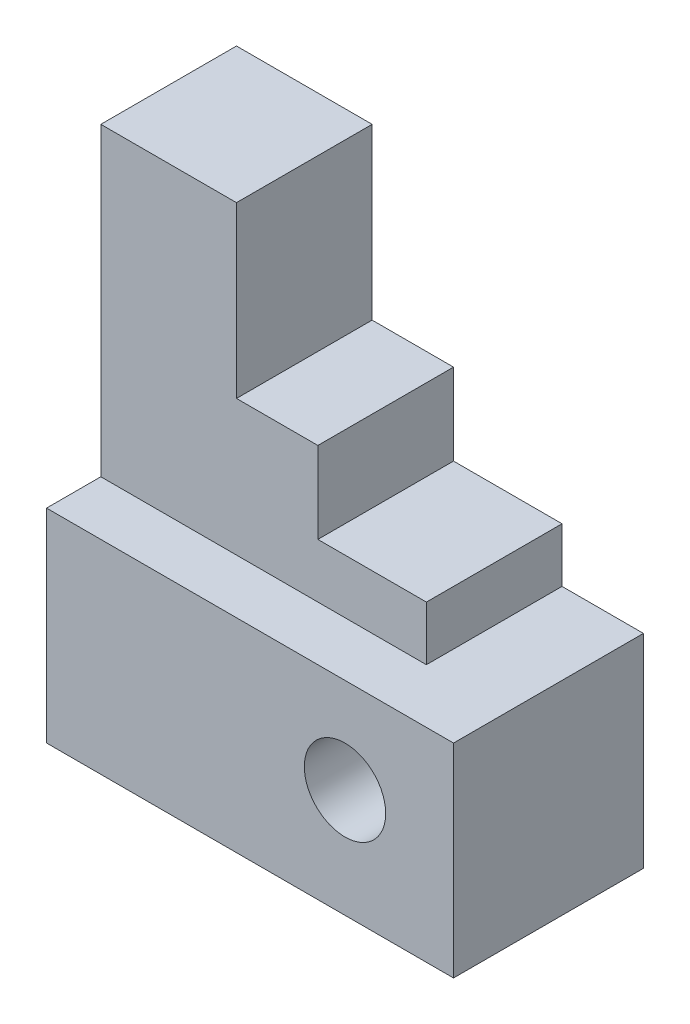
from build123d import *

# Parameters (mm, degrees)
SKETCH1_W           = 60
SKETCH1_H           = 30
SKETCH1_R           = 6
BOSS_EXTRUDE4_DEPTH = 28
SKETCH5_W           = 20
SKETCH5_H           = 25
SKETCH5_W_2         = 16
SKETCH5_H_2         = 8
BOSS_EXTRUDE5_DEPTH = 20


with BuildPart() as part:
    # Sketch1 → Boss-Extrude4 (new body)
    with BuildSketch(Plane.XY):
        with Locations((30, 15)):
            Rectangle(SKETCH1_W, SKETCH1_H)
        with Locations((44, 16)):
            Circle(SKETCH1_R, mode=Mode.SUBTRACT)
    extrude(amount=BOSS_EXTRUDE4_DEPTH)

    # Sketch5 → Boss-Extrude5 (add)
    with BuildSketch(Plane.XY):
        with Locations((10, 62.5)):
            Rectangle(SKETCH5_W, SKETCH5_H)
        Polygon((32, 50), (20, 50), (0, 50), (0, 30), (32, 30), (32, 38), align=None)
        with Locations((40, 34)):
            Rectangle(SKETCH5_W_2, SKETCH5_H_2)
    extrude(amount=BOSS_EXTRUDE5_DEPTH)


solid = part.part
